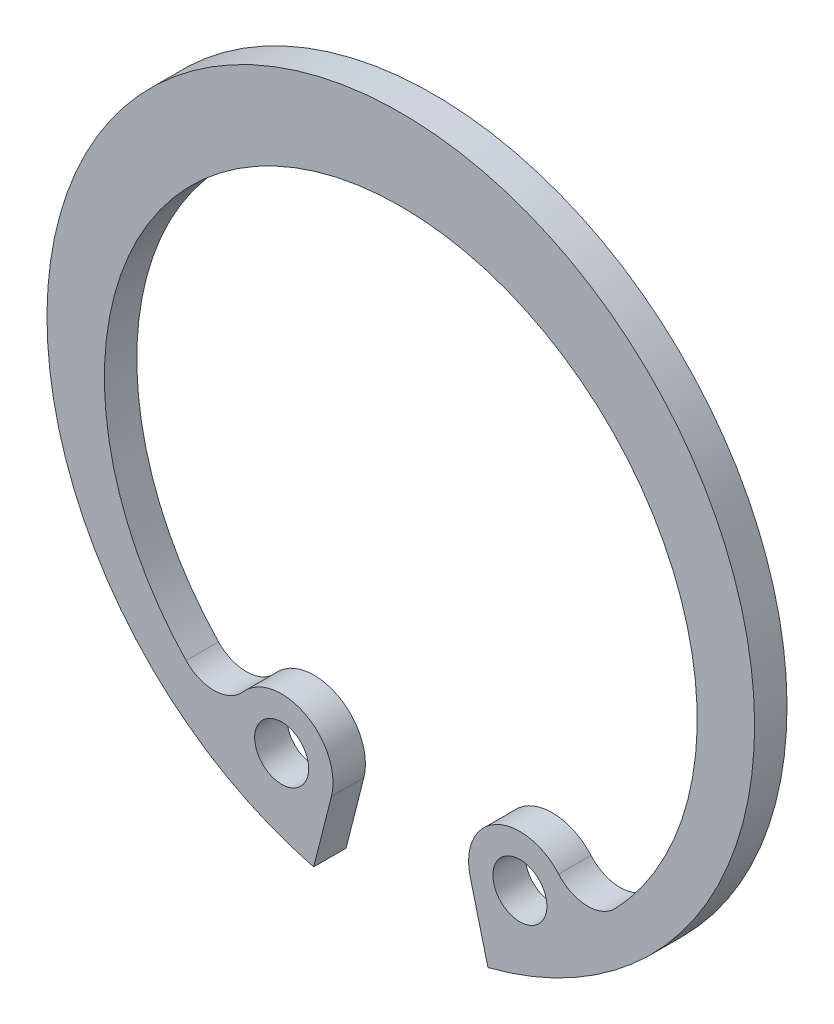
ISO-10303-21;
HEADER;
FILE_DESCRIPTION(('STEP AP214'),'2;1');
FILE_NAME('part.step','',(''),(''),'','','');
FILE_SCHEMA(('AUTOMOTIVE_DESIGN { 1 0 10303 214 1 1 1 1 }'));
ENDSEC;
DATA;
#1=APPLICATION_CONTEXT('core data for automotive mechanical design processes');
#2=APPLICATION_PROTOCOL_DEFINITION('international standard','automotive_design',2000,#1);
#3=PRODUCT_CONTEXT('',#1,'mechanical');
#4=PRODUCT('Part','Part','',(#3));
#5=PRODUCT_RELATED_PRODUCT_CATEGORY('part','',(#4));
#6=PRODUCT_DEFINITION_FORMATION('','',#4);
#7=PRODUCT_DEFINITION_CONTEXT('part definition',#1,'design');
#8=PRODUCT_DEFINITION('design','',#6,#7);
#9=PRODUCT_DEFINITION_SHAPE('','',#8);
#10=(LENGTH_UNIT() NAMED_UNIT(*) SI_UNIT(.MILLI.,.METRE.));
#11=(NAMED_UNIT(*) PLANE_ANGLE_UNIT() SI_UNIT($,.RADIAN.));
#12=(NAMED_UNIT(*) SI_UNIT($,.STERADIAN.) SOLID_ANGLE_UNIT());
#13=UNCERTAINTY_MEASURE_WITH_UNIT(LENGTH_MEASURE(1.E-05),#10,'distance_accuracy_value','');
#14=(GEOMETRIC_REPRESENTATION_CONTEXT(3) GLOBAL_UNCERTAINTY_ASSIGNED_CONTEXT((#13)) GLOBAL_UNIT_ASSIGNED_CONTEXT((#10,
#11,#12)) REPRESENTATION_CONTEXT('',''));
#15=CARTESIAN_POINT('',(0.,0.,0.));
#16=DIRECTION('',(0.,0.,1.));
#17=DIRECTION('',(1.,0.,0.));
#18=AXIS2_PLACEMENT_3D('',#15,#16,#17);
#19=CARTESIAN_POINT('',(0.,0.,-1.2));
#20=DIRECTION('',(0.,0.,1.));
#21=DIRECTION('',(1.,0.,0.));
#22=AXIS2_PLACEMENT_3D('',#19,#20,#21);
#23=CYLINDRICAL_SURFACE('',#22,13.1);
#24=CARTESIAN_POINT('',(0.,0.,0.));
#25=DIRECTION('',(0.,0.,1.));
#26=DIRECTION('',(1.,0.,0.));
#27=AXIS2_PLACEMENT_3D('',#24,#25,#26);
#28=CIRCLE('',#27,13.1);
#29=CARTESIAN_POINT('',(3.22587684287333,-12.6966026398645,0.));
#30=VERTEX_POINT('',#29);
#31=CARTESIAN_POINT('',(-3.22587684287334,-12.6966026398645,0.));
#32=VERTEX_POINT('',#31);
#33=EDGE_CURVE('E136',#30,#32,#28,.T.);
#34=ORIENTED_EDGE('',*,*,#33,.F.);
#35=DIRECTION('',(0.,0.,1.));
#36=VECTOR('',#35,1.);
#37=CARTESIAN_POINT('',(3.22587684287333,-12.6966026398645,-1.2));
#38=LINE('',#37,#36);
#39=CARTESIAN_POINT('',(3.22587684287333,-12.6966026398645,-1.2));
#40=VERTEX_POINT('',#39);
#41=EDGE_CURVE('E11',#40,#30,#38,.T.);
#42=ORIENTED_EDGE('',*,*,#41,.F.);
#43=CARTESIAN_POINT('',(0.,0.,-1.2));
#44=DIRECTION('',(0.,0.,1.));
#45=DIRECTION('',(1.,0.,0.));
#46=AXIS2_PLACEMENT_3D('',#43,#44,#45);
#47=CIRCLE('',#46,13.1);
#48=CARTESIAN_POINT('',(-3.22587684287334,-12.6966026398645,-1.2));
#49=VERTEX_POINT('',#48);
#50=EDGE_CURVE('E157',#40,#49,#47,.T.);
#51=ORIENTED_EDGE('',*,*,#50,.T.);
#52=DIRECTION('',(0.,0.,1.));
#53=VECTOR('',#52,1.);
#54=CARTESIAN_POINT('',(-3.22587684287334,-12.6966026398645,-1.2));
#55=LINE('',#54,#53);
#56=EDGE_CURVE('E42',#49,#32,#55,.T.);
#57=ORIENTED_EDGE('',*,*,#56,.T.);
#58=EDGE_LOOP('',(#34,#42,#51,#57));
#59=FACE_BOUND('',#58,.T.);
#60=ADVANCED_FACE('F39',(#59),#23,.T.);
#61=CARTESIAN_POINT('',(3.22587684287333,-12.6966026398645,-1.2));
#62=DIRECTION('',(-0.969206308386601,-0.246250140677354,0.));
#63=DIRECTION('',(0.246250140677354,-0.969206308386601,0.));
#64=AXIS2_PLACEMENT_3D('',#61,#62,#63);
#65=PLANE('',#64);
#66=DIRECTION('',(0.246250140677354,-0.969206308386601,0.));
#67=VECTOR('',#66,1.);
#68=CARTESIAN_POINT('',(3.22587684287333,-12.6966026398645,0.));
#69=LINE('',#68,#67);
#70=CARTESIAN_POINT('',(2.56797694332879,-10.1072001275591,0.));
#71=VERTEX_POINT('',#70);
#72=EDGE_CURVE('E155',#71,#30,#69,.T.);
#73=ORIENTED_EDGE('',*,*,#72,.F.);
#74=DIRECTION('',(0.,0.,1.));
#75=VECTOR('',#74,1.);
#76=CARTESIAN_POINT('',(2.56797694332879,-10.1072001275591,-1.2));
#77=LINE('',#76,#75);
#78=CARTESIAN_POINT('',(2.56797694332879,-10.1072001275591,-1.2));
#79=VERTEX_POINT('',#78);
#80=EDGE_CURVE('E48',#79,#71,#77,.T.);
#81=ORIENTED_EDGE('',*,*,#80,.F.);
#82=DIRECTION('',(0.246250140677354,-0.969206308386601,0.));
#83=VECTOR('',#82,1.);
#84=CARTESIAN_POINT('',(3.22587684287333,-12.6966026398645,-1.2));
#85=LINE('',#84,#83);
#86=EDGE_CURVE('E126',#79,#40,#85,.T.);
#87=ORIENTED_EDGE('',*,*,#86,.T.);
#88=ORIENTED_EDGE('',*,*,#41,.T.);
#89=EDGE_LOOP('',(#73,#81,#87,#88));
#90=FACE_BOUND('',#89,.T.);
#91=ADVANCED_FACE('F169',(#90),#65,.T.);
#92=CARTESIAN_POINT('',(4.40946892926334,-9.63932486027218,-1.2));
#93=DIRECTION('',(0.,0.,1.));
#94=DIRECTION('',(1.,0.,0.));
#95=AXIS2_PLACEMENT_3D('',#92,#93,#94);
#96=CYLINDRICAL_SURFACE('',#95,1.9);
#97=CARTESIAN_POINT('',(4.40946892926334,-9.63932486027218,0.));
#98=DIRECTION('',(0.,0.,1.));
#99=DIRECTION('',(1.,0.,0.));
#100=AXIS2_PLACEMENT_3D('',#97,#98,#99);
#101=CIRCLE('',#100,1.9);
#102=CARTESIAN_POINT('',(5.84323197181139,-8.3925997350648,0.));
#103=VERTEX_POINT('',#102);
#104=EDGE_CURVE('E113',#103,#71,#101,.T.);
#105=ORIENTED_EDGE('',*,*,#104,.F.);
#106=DIRECTION('',(0.,0.,1.));
#107=VECTOR('',#106,1.);
#108=CARTESIAN_POINT('',(5.84323197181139,-8.3925997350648,-1.2));
#109=LINE('',#108,#107);
#110=CARTESIAN_POINT('',(5.84323197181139,-8.3925997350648,-1.2));
#111=VERTEX_POINT('',#110);
#112=EDGE_CURVE('E108',#111,#103,#109,.T.);
#113=ORIENTED_EDGE('',*,*,#112,.F.);
#114=CARTESIAN_POINT('',(4.40946892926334,-9.63932486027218,-1.2));
#115=DIRECTION('',(0.,0.,1.));
#116=DIRECTION('',(1.,0.,0.));
#117=AXIS2_PLACEMENT_3D('',#114,#115,#116);
#118=CIRCLE('',#117,1.9);
#119=EDGE_CURVE('E111',#111,#79,#118,.T.);
#120=ORIENTED_EDGE('',*,*,#119,.T.);
#121=ORIENTED_EDGE('',*,*,#80,.T.);
#122=EDGE_LOOP('',(#105,#113,#120,#121));
#123=FACE_BOUND('',#122,.T.);
#124=ADVANCED_FACE('F110',(#123),#96,.T.);
#125=CARTESIAN_POINT('',(6.91855425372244,-7.45755589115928,-1.2));
#126=DIRECTION('',(0.,0.,1.));
#127=DIRECTION('',(1.,0.,0.));
#128=AXIS2_PLACEMENT_3D('',#125,#126,#127);
#129=CYLINDRICAL_SURFACE('',#128,1.425);
#130=CARTESIAN_POINT('',(6.91855425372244,-7.45755589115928,0.));
#131=DIRECTION('',(0.,0.,-1.));
#132=DIRECTION('',(1.,0.,0.));
#133=AXIS2_PLACEMENT_3D('',#130,#131,#132);
#134=CIRCLE('',#133,1.425);
#135=CARTESIAN_POINT('',(7.95092429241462,-8.43981711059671,0.));
#136=VERTEX_POINT('',#135);
#137=EDGE_CURVE('E152',#136,#103,#134,.T.);
#138=ORIENTED_EDGE('',*,*,#137,.F.);
#139=DIRECTION('',(0.,0.,1.));
#140=VECTOR('',#139,1.);
#141=CARTESIAN_POINT('',(7.95092429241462,-8.43981711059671,-1.2));
#142=LINE('',#141,#140);
#143=CARTESIAN_POINT('',(7.95092429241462,-8.43981711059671,-1.2));
#144=VERTEX_POINT('',#143);
#145=EDGE_CURVE('E118',#144,#136,#142,.T.);
#146=ORIENTED_EDGE('',*,*,#145,.F.);
#147=CARTESIAN_POINT('',(6.91855425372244,-7.45755589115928,-1.2));
#148=DIRECTION('',(0.,0.,-1.));
#149=DIRECTION('',(1.,0.,0.));
#150=AXIS2_PLACEMENT_3D('',#147,#148,#149);
#151=CIRCLE('',#150,1.425);
#152=EDGE_CURVE('E124',#144,#111,#151,.T.);
#153=ORIENTED_EDGE('',*,*,#152,.T.);
#154=ORIENTED_EDGE('',*,*,#112,.T.);
#155=EDGE_LOOP('',(#138,#146,#153,#154));
#156=FACE_BOUND('',#155,.T.);
#157=ADVANCED_FACE('F128',(#156),#129,.F.);
#158=CARTESIAN_POINT('',(0.,-0.874812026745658,-1.2));
#159=DIRECTION('',(0.,0.,1.));
#160=DIRECTION('',(1.,0.,0.));
#161=AXIS2_PLACEMENT_3D('',#158,#159,#160);
#162=CYLINDRICAL_SURFACE('',#161,10.9748120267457);
#163=CARTESIAN_POINT('',(0.,-0.874812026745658,0.));
#164=DIRECTION('',(0.,0.,-1.));
#165=DIRECTION('',(1.,0.,0.));
#166=AXIS2_PLACEMENT_3D('',#163,#164,#165);
#167=CIRCLE('',#166,10.9748120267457);
#168=CARTESIAN_POINT('',(-7.95092429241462,-8.4398171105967,0.));
#169=VERTEX_POINT('',#168);
#170=EDGE_CURVE('E149',#169,#136,#167,.T.);
#171=ORIENTED_EDGE('',*,*,#170,.F.);
#172=DIRECTION('',(0.,0.,1.));
#173=VECTOR('',#172,1.);
#174=CARTESIAN_POINT('',(-7.95092429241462,-8.4398171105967,-1.2));
#175=LINE('',#174,#173);
#176=CARTESIAN_POINT('',(-7.95092429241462,-8.4398171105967,-1.2));
#177=VERTEX_POINT('',#176);
#178=EDGE_CURVE('E161',#177,#169,#175,.T.);
#179=ORIENTED_EDGE('',*,*,#178,.F.);
#180=CARTESIAN_POINT('',(0.,-0.874812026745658,-1.2));
#181=DIRECTION('',(0.,0.,-1.));
#182=DIRECTION('',(1.,0.,0.));
#183=AXIS2_PLACEMENT_3D('',#180,#181,#182);
#184=CIRCLE('',#183,10.9748120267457);
#185=EDGE_CURVE('E129',#177,#144,#184,.T.);
#186=ORIENTED_EDGE('',*,*,#185,.T.);
#187=ORIENTED_EDGE('',*,*,#145,.T.);
#188=EDGE_LOOP('',(#171,#179,#186,#187));
#189=FACE_BOUND('',#188,.T.);
#190=ADVANCED_FACE('F182',(#189),#162,.F.);
#191=CARTESIAN_POINT('',(-6.91855425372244,-7.45755589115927,-1.2));
#192=DIRECTION('',(0.,0.,1.));
#193=DIRECTION('',(1.,0.,0.));
#194=AXIS2_PLACEMENT_3D('',#191,#192,#193);
#195=CYLINDRICAL_SURFACE('',#194,1.425);
#196=CARTESIAN_POINT('',(-6.91855425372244,-7.45755589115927,0.));
#197=DIRECTION('',(0.,0.,-1.));
#198=DIRECTION('',(1.,0.,0.));
#199=AXIS2_PLACEMENT_3D('',#196,#197,#198);
#200=CIRCLE('',#199,1.425);
#201=CARTESIAN_POINT('',(-5.8432319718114,-8.3925997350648,0.));
#202=VERTEX_POINT('',#201);
#203=EDGE_CURVE('E146',#202,#169,#200,.T.);
#204=ORIENTED_EDGE('',*,*,#203,.F.);
#205=DIRECTION('',(0.,0.,1.));
#206=VECTOR('',#205,1.);
#207=CARTESIAN_POINT('',(-5.8432319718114,-8.3925997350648,-1.2));
#208=LINE('',#207,#206);
#209=CARTESIAN_POINT('',(-5.8432319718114,-8.3925997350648,-1.2));
#210=VERTEX_POINT('',#209);
#211=EDGE_CURVE('E163',#210,#202,#208,.T.);
#212=ORIENTED_EDGE('',*,*,#211,.F.);
#213=CARTESIAN_POINT('',(-6.91855425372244,-7.45755589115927,-1.2));
#214=DIRECTION('',(0.,0.,-1.));
#215=DIRECTION('',(1.,0.,0.));
#216=AXIS2_PLACEMENT_3D('',#213,#214,#215);
#217=CIRCLE('',#216,1.425);
#218=EDGE_CURVE('E131',#210,#177,#217,.T.);
#219=ORIENTED_EDGE('',*,*,#218,.T.);
#220=ORIENTED_EDGE('',*,*,#178,.T.);
#221=EDGE_LOOP('',(#204,#212,#219,#220));
#222=FACE_BOUND('',#221,.T.);
#223=ADVANCED_FACE('F185',(#222),#195,.F.);
#224=CARTESIAN_POINT('',(-4.40946892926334,-9.63932486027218,-1.2));
#225=DIRECTION('',(0.,0.,1.));
#226=DIRECTION('',(1.,0.,0.));
#227=AXIS2_PLACEMENT_3D('',#224,#225,#226);
#228=CYLINDRICAL_SURFACE('',#227,1.9);
#229=CARTESIAN_POINT('',(-4.40946892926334,-9.63932486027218,0.));
#230=DIRECTION('',(0.,0.,1.));
#231=DIRECTION('',(1.,0.,0.));
#232=AXIS2_PLACEMENT_3D('',#229,#230,#231);
#233=CIRCLE('',#232,1.9);
#234=CARTESIAN_POINT('',(-2.5679769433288,-10.1072001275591,0.));
#235=VERTEX_POINT('',#234);
#236=EDGE_CURVE('E143',#235,#202,#233,.T.);
#237=ORIENTED_EDGE('',*,*,#236,.F.);
#238=DIRECTION('',(0.,0.,1.));
#239=VECTOR('',#238,1.);
#240=CARTESIAN_POINT('',(-2.5679769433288,-10.1072001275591,-1.2));
#241=LINE('',#240,#239);
#242=CARTESIAN_POINT('',(-2.5679769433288,-10.1072001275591,-1.2));
#243=VERTEX_POINT('',#242);
#244=EDGE_CURVE('E164',#243,#235,#241,.T.);
#245=ORIENTED_EDGE('',*,*,#244,.F.);
#246=CARTESIAN_POINT('',(-4.40946892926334,-9.63932486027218,-1.2));
#247=DIRECTION('',(0.,0.,1.));
#248=DIRECTION('',(1.,0.,0.));
#249=AXIS2_PLACEMENT_3D('',#246,#247,#248);
#250=CIRCLE('',#249,1.9);
#251=EDGE_CURVE('E231',#243,#210,#250,.T.);
#252=ORIENTED_EDGE('',*,*,#251,.T.);
#253=ORIENTED_EDGE('',*,*,#211,.T.);
#254=EDGE_LOOP('',(#237,#245,#252,#253));
#255=FACE_BOUND('',#254,.T.);
#256=ADVANCED_FACE('F189',(#255),#228,.T.);
#257=CARTESIAN_POINT('',(-3.22587684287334,-12.6966026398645,-1.2));
#258=DIRECTION('',(0.969206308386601,-0.246250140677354,0.));
#259=DIRECTION('',(0.246250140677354,0.969206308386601,0.));
#260=AXIS2_PLACEMENT_3D('',#257,#258,#259);
#261=PLANE('',#260);
#262=DIRECTION('',(0.246250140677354,0.969206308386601,0.));
#263=VECTOR('',#262,1.);
#264=CARTESIAN_POINT('',(-3.22587684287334,-12.6966026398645,0.));
#265=LINE('',#264,#263);
#266=EDGE_CURVE('E139',#32,#235,#265,.T.);
#267=ORIENTED_EDGE('',*,*,#266,.F.);
#268=ORIENTED_EDGE('',*,*,#56,.F.);
#269=DIRECTION('',(0.246250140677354,0.969206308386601,0.));
#270=VECTOR('',#269,1.);
#271=CARTESIAN_POINT('',(-3.22587684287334,-12.6966026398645,-1.2));
#272=LINE('',#271,#270);
#273=EDGE_CURVE('E229',#49,#243,#272,.T.);
#274=ORIENTED_EDGE('',*,*,#273,.T.);
#275=ORIENTED_EDGE('',*,*,#244,.T.);
#276=EDGE_LOOP('',(#267,#268,#274,#275));
#277=FACE_BOUND('',#276,.T.);
#278=ADVANCED_FACE('F166',(#277),#261,.T.);
#279=CARTESIAN_POINT('',(0.,0.,-1.2));
#280=DIRECTION('',(0.,0.,1.));
#281=DIRECTION('',(1.,0.,0.));
#282=AXIS2_PLACEMENT_3D('',#279,#280,#281);
#283=PLANE('',#282);
#284=CARTESIAN_POINT('',(-4.40946892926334,-9.63932486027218,-1.2));
#285=DIRECTION('',(0.,0.,1.));
#286=DIRECTION('',(1.,0.,0.));
#287=AXIS2_PLACEMENT_3D('',#284,#285,#286);
#288=CIRCLE('',#287,1.);
#289=CARTESIAN_POINT('',(-3.40946892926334,-9.63932486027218,-1.2));
#290=VERTEX_POINT('',#289);
#291=EDGE_CURVE('E216',#290,#290,#288,.T.);
#292=ORIENTED_EDGE('',*,*,#291,.T.);
#293=EDGE_LOOP('',(#292));
#294=FACE_BOUND('',#293,.T.);
#295=CARTESIAN_POINT('',(4.40946892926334,-9.63932486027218,-1.2));
#296=DIRECTION('',(0.,0.,1.));
#297=DIRECTION('',(1.,0.,0.));
#298=AXIS2_PLACEMENT_3D('',#295,#296,#297);
#299=CIRCLE('',#298,1.);
#300=CARTESIAN_POINT('',(5.40946892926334,-9.63932486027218,-1.2));
#301=VERTEX_POINT('',#300);
#302=EDGE_CURVE('E140',#301,#301,#299,.T.);
#303=ORIENTED_EDGE('',*,*,#302,.T.);
#304=EDGE_LOOP('',(#303));
#305=FACE_BOUND('',#304,.T.);
#306=ORIENTED_EDGE('',*,*,#50,.F.);
#307=ORIENTED_EDGE('',*,*,#86,.F.);
#308=ORIENTED_EDGE('',*,*,#119,.F.);
#309=ORIENTED_EDGE('',*,*,#152,.F.);
#310=ORIENTED_EDGE('',*,*,#185,.F.);
#311=ORIENTED_EDGE('',*,*,#218,.F.);
#312=ORIENTED_EDGE('',*,*,#251,.F.);
#313=ORIENTED_EDGE('',*,*,#273,.F.);
#314=EDGE_LOOP('',(#306,#307,#308,#309,#310,#311,#312,#313));
#315=FACE_BOUND('',#314,.T.);
#316=ADVANCED_FACE('F122',(#294,#305,#315),#283,.F.);
#317=CARTESIAN_POINT('',(0.,0.,0.));
#318=DIRECTION('',(0.,0.,1.));
#319=DIRECTION('',(1.,0.,0.));
#320=AXIS2_PLACEMENT_3D('',#317,#318,#319);
#321=PLANE('',#320);
#322=CARTESIAN_POINT('',(-4.40946892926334,-9.63932486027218,0.));
#323=DIRECTION('',(0.,0.,1.));
#324=DIRECTION('',(1.,0.,0.));
#325=AXIS2_PLACEMENT_3D('',#322,#323,#324);
#326=CIRCLE('',#325,1.);
#327=CARTESIAN_POINT('',(-3.40946892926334,-9.63932486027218,0.));
#328=VERTEX_POINT('',#327);
#329=EDGE_CURVE('E219',#328,#328,#326,.T.);
#330=ORIENTED_EDGE('',*,*,#329,.F.);
#331=EDGE_LOOP('',(#330));
#332=FACE_BOUND('',#331,.T.);
#333=CARTESIAN_POINT('',(4.40946892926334,-9.63932486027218,0.));
#334=DIRECTION('',(0.,0.,1.));
#335=DIRECTION('',(1.,0.,0.));
#336=AXIS2_PLACEMENT_3D('',#333,#334,#335);
#337=CIRCLE('',#336,1.);
#338=CARTESIAN_POINT('',(5.40946892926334,-9.63932486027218,0.));
#339=VERTEX_POINT('',#338);
#340=EDGE_CURVE('E221',#339,#339,#337,.T.);
#341=ORIENTED_EDGE('',*,*,#340,.F.);
#342=EDGE_LOOP('',(#341));
#343=FACE_BOUND('',#342,.T.);
#344=ORIENTED_EDGE('',*,*,#33,.T.);
#345=ORIENTED_EDGE('',*,*,#266,.T.);
#346=ORIENTED_EDGE('',*,*,#236,.T.);
#347=ORIENTED_EDGE('',*,*,#203,.T.);
#348=ORIENTED_EDGE('',*,*,#170,.T.);
#349=ORIENTED_EDGE('',*,*,#137,.T.);
#350=ORIENTED_EDGE('',*,*,#104,.T.);
#351=ORIENTED_EDGE('',*,*,#72,.T.);
#352=EDGE_LOOP('',(#344,#345,#346,#347,#348,#349,#350,#351));
#353=FACE_BOUND('',#352,.T.);
#354=ADVANCED_FACE('F168',(#332,#343,#353),#321,.T.);
#355=CARTESIAN_POINT('',(4.40946892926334,-9.63932486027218,-1.2));
#356=DIRECTION('',(0.,0.,1.));
#357=DIRECTION('',(1.,0.,0.));
#358=AXIS2_PLACEMENT_3D('',#355,#356,#357);
#359=CYLINDRICAL_SURFACE('',#358,1.);
#360=ORIENTED_EDGE('',*,*,#302,.F.);
#361=EDGE_LOOP('',(#360));
#362=FACE_BOUND('',#361,.T.);
#363=ORIENTED_EDGE('',*,*,#340,.T.);
#364=EDGE_LOOP('',(#363));
#365=FACE_BOUND('',#364,.T.);
#366=ADVANCED_FACE('F201',(#362,#365),#359,.F.);
#367=CARTESIAN_POINT('',(-4.40946892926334,-9.63932486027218,-1.2));
#368=DIRECTION('',(0.,0.,1.));
#369=DIRECTION('',(1.,0.,0.));
#370=AXIS2_PLACEMENT_3D('',#367,#368,#369);
#371=CYLINDRICAL_SURFACE('',#370,1.);
#372=ORIENTED_EDGE('',*,*,#291,.F.);
#373=EDGE_LOOP('',(#372));
#374=FACE_BOUND('',#373,.T.);
#375=ORIENTED_EDGE('',*,*,#329,.T.);
#376=EDGE_LOOP('',(#375));
#377=FACE_BOUND('',#376,.T.);
#378=ADVANCED_FACE('F208',(#374,#377),#371,.F.);
#379=CLOSED_SHELL('',(#60,#91,#124,#157,#190,#223,#256,#278,#316,#354,#366,#378));
#380=MANIFOLD_SOLID_BREP('B2',#379);
#381=ADVANCED_BREP_SHAPE_REPRESENTATION('',(#18,#380),#14);
#382=SHAPE_DEFINITION_REPRESENTATION(#9,#381);
ENDSEC;
END-ISO-10303-21;
